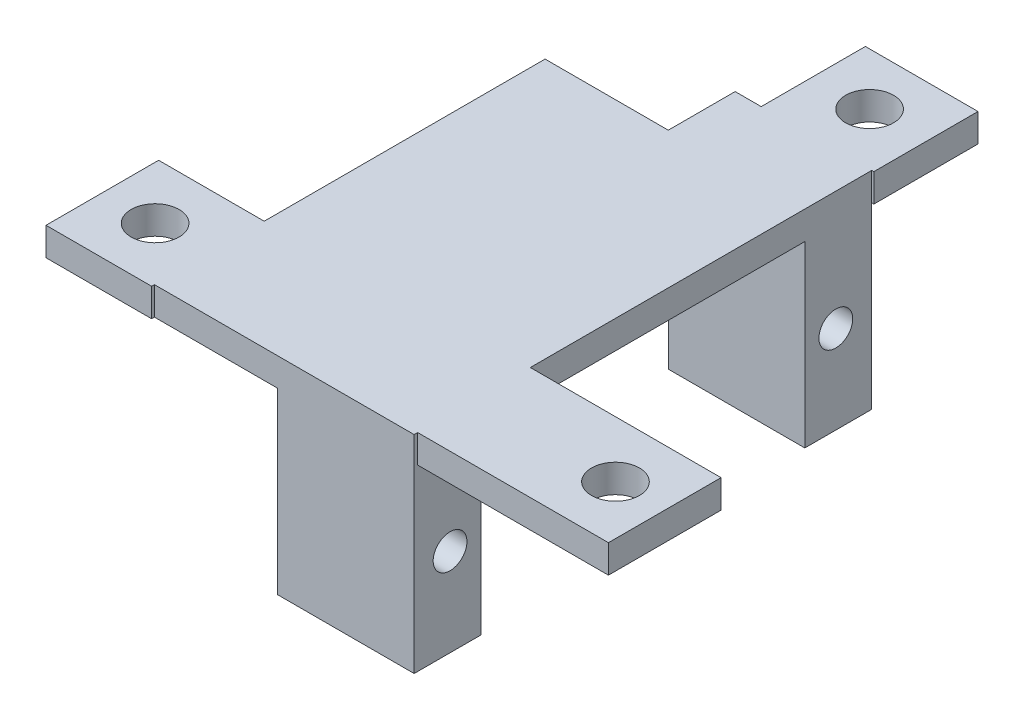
from build123d import *

# Parameters (mm, degrees)
BOSS_EXTRUDE1_DEPTH     = 2
SKETCH1_5_W             = 9.7
SKETCH1_5_H             = 4.75
BOSS_EXTRUDE2_DEPTH     = 12.7
CUT_EXTRUDE1_DEPTH      = 37.682591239
CUT_EXTRUDE1_DEPTH_BACK = 37.682591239
SKETCH1_6_R             = 1.7
CUT_EXTRUDE2_START      = 0.95
SKETCH2_R               = 1.2
CUT_EXTRUDE2_DEPTH      = 8


with BuildPart() as part:
    # Sketch1 → Boss-Extrude1 (new body)
    with BuildSketch(Plane(origin=(0, 0, 0), x_dir=(1, 0, 0), z_dir=(0, 1, 0))):
        Polygon((0.95, 16.25), (1.1, 16.25), (1.1, 23.65), (-6.9, 23.65), (-6.9, 16.25), (-8.75, 16.25), (-8.75, 11.5), (-17.5, 11.5), (-17.5, -8.45), (-25, -8.45), (-25, -16.45), (-17.5, -16.45), (-17.5, -16.25), (0.95, -16.25), (0.95, -16), (14.5, -16), (14.5, -8), (0.95, -8), align=None)
    extrude(amount=BOSS_EXTRUDE1_DEPTH)

    # Sketch1_5 → Boss-Extrude2 (add)
    with BuildSketch(Plane(origin=(0, 0, 0), x_dir=(1, 0, 0), z_dir=(0, 1, 0))):
        with Locations((-3.9, 13.875)):
            Rectangle(SKETCH1_5_W, SKETCH1_5_H)
        with Locations((-3.9, -13.875)):
            Rectangle(SKETCH1_5_W, SKETCH1_5_H)
    extrude(amount=-BOSS_EXTRUDE2_DEPTH)

    # Sketch1_6 → Cut-Extrude1 (cut, two sides: drawn at the far end of the back side and taken through both)
    with BuildSketch(Plane(origin=(0, 0, 0), x_dir=(1, 0, 0), z_dir=(0, 1, 0)).offset(-CUT_EXTRUDE1_DEPTH_BACK)):
        with Locations(Location((-2.9, 19.95, 0), (0, 0, 270))):
            Circle(SKETCH1_6_R)
        with Locations(Location((11, -12, 0), (0, 0, 270))):
            Circle(SKETCH1_6_R)
        with Locations(Location((-21.25, -12.45, 0), (0, 0, 270))):
            Circle(SKETCH1_6_R)
    extrude(amount=CUT_EXTRUDE1_DEPTH + CUT_EXTRUDE1_DEPTH_BACK, mode=Mode.SUBTRACT)

    # Sketch2 → Cut-Extrude2 (cut)
    with BuildSketch(Plane(origin=(0, 0, 0), x_dir=(0, 0, -1), z_dir=(1, 0, 0)).offset(CUT_EXTRUDE2_START)):
        with Locations(Location((-13.7, -6.45, 0), (0, 0, 180))):
            Circle(SKETCH2_R)
        with Locations(Location((13.7, -6.45, 0), (0, 0, 180))):
            Circle(SKETCH2_R)
    extrude(amount=-CUT_EXTRUDE2_DEPTH, mode=Mode.SUBTRACT)


solid = part.part
